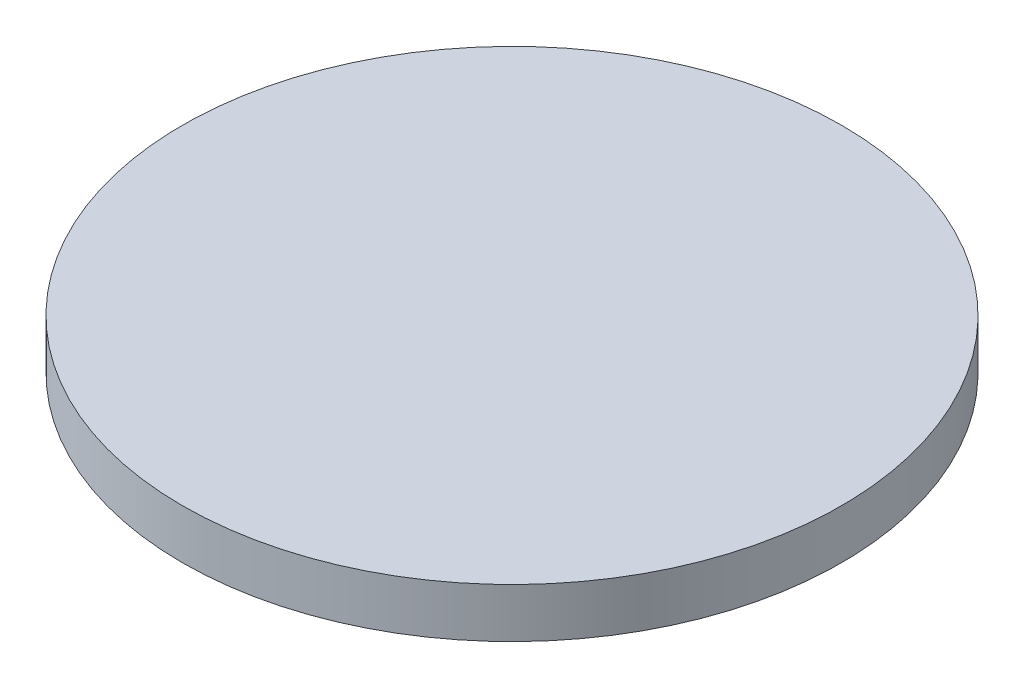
from build123d import *

# Parameters (mm, degrees)
SKETCH1_R           = 20
BOSS_EXTRUDE1_DEPTH = 3


with BuildPart() as part:
    # Sketch1 → Boss-Extrude1 (new body)
    with BuildSketch(Plane(origin=(0, 0, 0), x_dir=(1, 0, 0), z_dir=(0, 1, 0))):
        with Locations(Location((0, 0, 0), (0, 0, 270))):
            Circle(SKETCH1_R)
    extrude(amount=BOSS_EXTRUDE1_DEPTH)


solid = part.part
